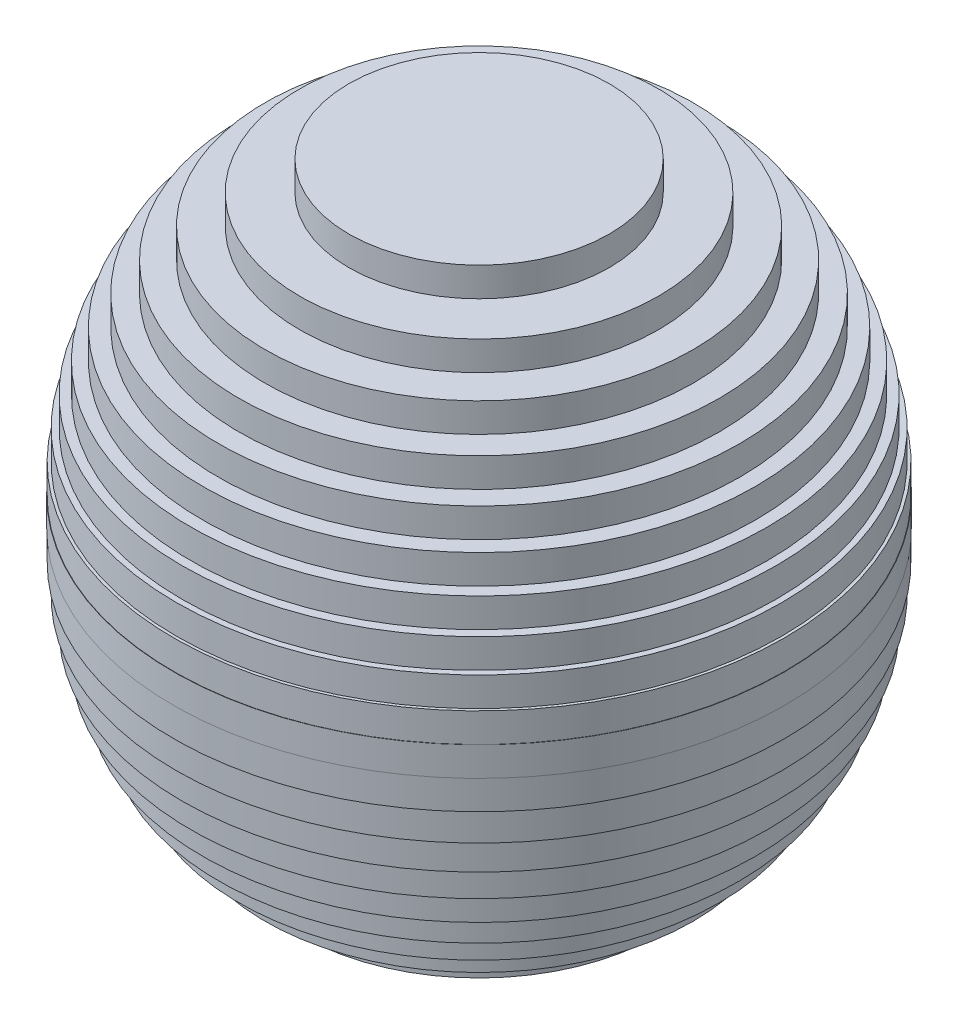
from build123d import *


with BuildPart() as part:
    # Sketch5 → Revolve5 (revolve)
    with BuildSketch(Plane.XY):
        Polygon((52.5, 2.5), (52.5, -2.5), (52.440442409, -2.5), (52.440442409, -7.5), (51.961524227, -7.5), (51.961524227, -12.5), (50.990195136, -12.5), (50.990195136, -17.5), (49.497474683, -17.5), (49.497474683, -22.5), (47.434164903, -22.5), (47.434164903, -27.5), (44.72135955, -27.5), (44.72135955, -32.5), (41.231056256, -32.5), (41.231056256, -37.5), (36.742346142, -37.5), (36.742346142, -42.5), (30.822070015, -42.5), (30.822070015, -47.5), (22.360679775, -47.5), (22.360679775, -52.5), (0, -52.5), (0, 52.5), (22.360679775, 52.5), (22.360679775, 47.5), (30.822070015, 47.5), (30.822070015, 42.5), (36.742346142, 42.5), (36.742346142, 37.5), (41.231056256, 37.5), (41.231056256, 32.5), (44.72135955, 32.5), (44.72135955, 27.5), (47.434164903, 27.5), (47.434164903, 22.5), (49.497474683, 22.5), (49.497474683, 17.5), (50.990195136, 17.5), (50.990195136, 12.5), (51.961524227, 12.5), (51.961524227, 7.5), (52.440442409, 7.5), (52.440442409, 2.5), align=None)
    revolve(axis=Axis((0, -52.5, 0), (0, 1, 0)))


solid = part.part
